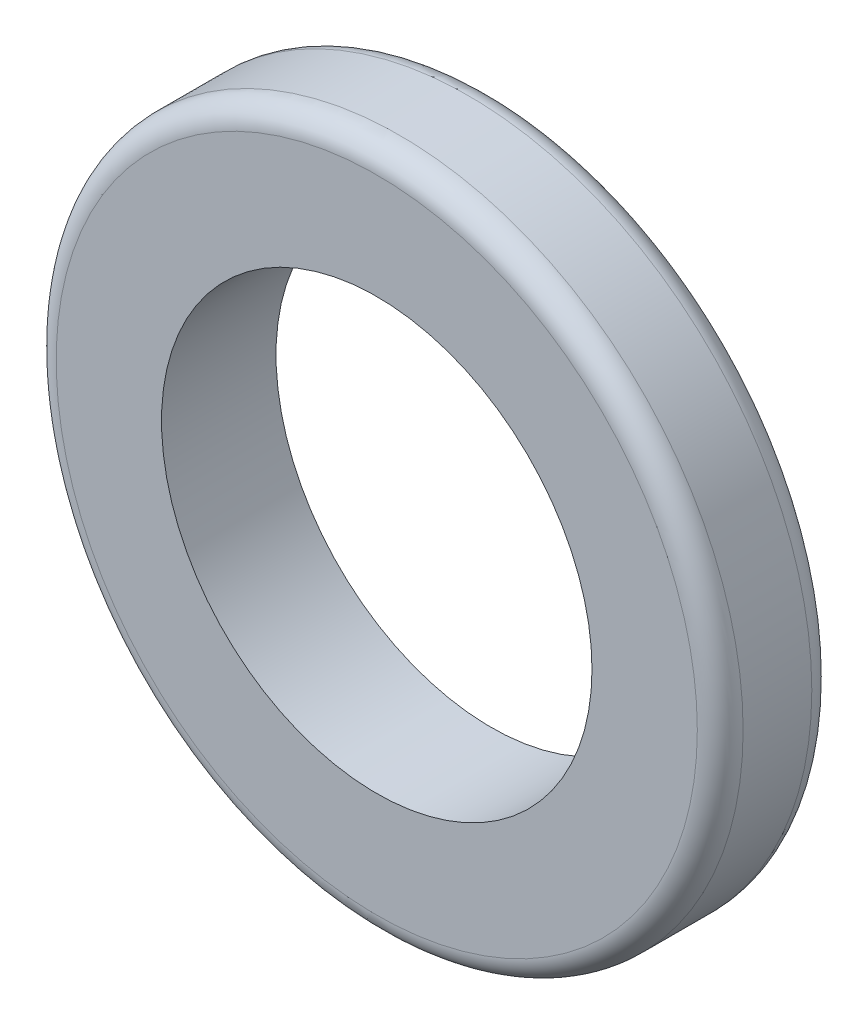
from build123d import *

# Parameters (mm, degrees)
SKETCH1_R           = 38.1
SKETCH1_R_2         = 23.876
BOSS_EXTRUDE1_DEPTH = 12.7
FILLET1_R           = 2.54


with BuildPart() as part:
    # Sketch1 → Boss-Extrude1 (new body)
    with BuildSketch(Plane.XY):
        Circle(SKETCH1_R)
        Circle(SKETCH1_R_2, mode=Mode.SUBTRACT)
    extrude(amount=BOSS_EXTRUDE1_DEPTH)

    # Fillet1
    fillet1_edges = [part.edges().sort_by_distance(p)[0] for p in [
        (-38.1, 0, 0),
        (-38.1, 0, 12.7),
    ]]
    fillet(fillet1_edges, radius=FILLET1_R)


solid = part.part
